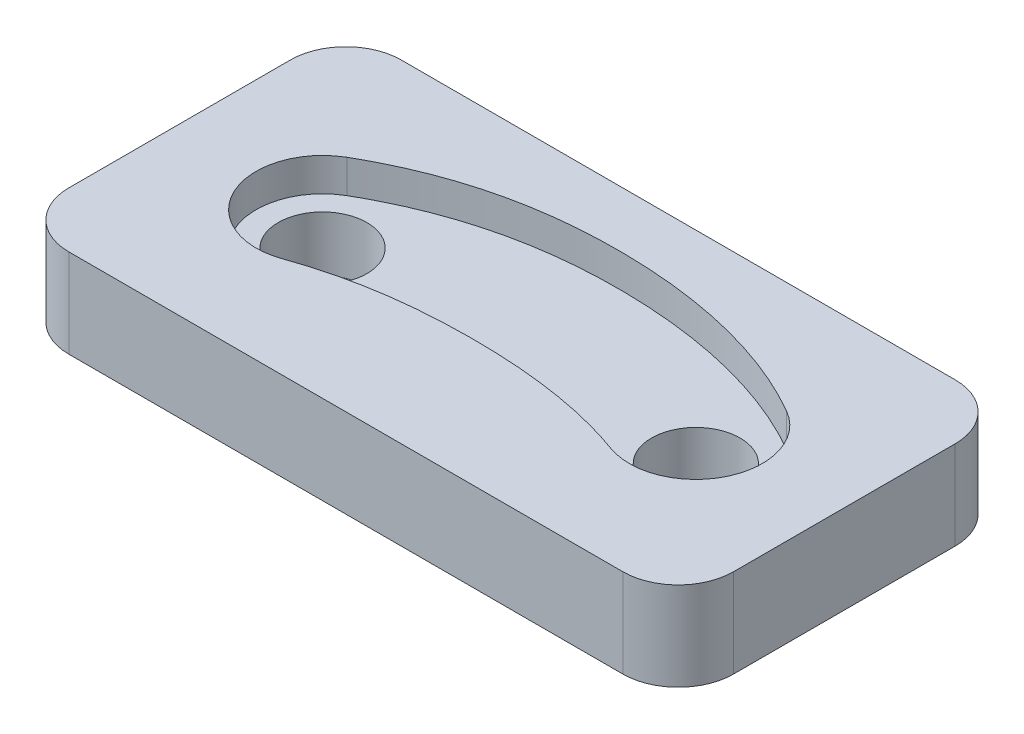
ISO-10303-21;
HEADER;
FILE_DESCRIPTION(('STEP AP214'),'2;1');
FILE_NAME('part.step','',(''),(''),'','','');
FILE_SCHEMA(('AUTOMOTIVE_DESIGN { 1 0 10303 214 1 1 1 1 }'));
ENDSEC;
DATA;
#1=APPLICATION_CONTEXT('core data for automotive mechanical design processes');
#2=APPLICATION_PROTOCOL_DEFINITION('international standard','automotive_design',2000,#1);
#3=PRODUCT_CONTEXT('',#1,'mechanical');
#4=PRODUCT('Part','Part','',(#3));
#5=PRODUCT_RELATED_PRODUCT_CATEGORY('part','',(#4));
#6=PRODUCT_DEFINITION_FORMATION('','',#4);
#7=PRODUCT_DEFINITION_CONTEXT('part definition',#1,'design');
#8=PRODUCT_DEFINITION('design','',#6,#7);
#9=PRODUCT_DEFINITION_SHAPE('','',#8);
#10=(LENGTH_UNIT() NAMED_UNIT(*) SI_UNIT(.MILLI.,.METRE.));
#11=(NAMED_UNIT(*) PLANE_ANGLE_UNIT() SI_UNIT($,.RADIAN.));
#12=(NAMED_UNIT(*) SI_UNIT($,.STERADIAN.) SOLID_ANGLE_UNIT());
#13=UNCERTAINTY_MEASURE_WITH_UNIT(LENGTH_MEASURE(1.E-05),#10,'distance_accuracy_value','');
#14=(GEOMETRIC_REPRESENTATION_CONTEXT(3) GLOBAL_UNCERTAINTY_ASSIGNED_CONTEXT((#13)) GLOBAL_UNIT_ASSIGNED_CONTEXT((#10,
#11,#12)) REPRESENTATION_CONTEXT('',''));
#15=CARTESIAN_POINT('',(0.,0.,0.));
#16=DIRECTION('',(0.,0.,1.));
#17=DIRECTION('',(1.,0.,0.));
#18=AXIS2_PLACEMENT_3D('',#15,#16,#17);
#19=CARTESIAN_POINT('',(0.,11.,0.));
#20=DIRECTION('',(0.,1.,0.));
#21=DIRECTION('',(0.,0.,1.));
#22=AXIS2_PLACEMENT_3D('',#19,#20,#21);
#23=PLANE('',#22);
#24=CARTESIAN_POINT('',(22.9718751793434,11.,17.9993237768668));
#25=CARTESIAN_POINT('',(16.8640977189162,11.,14.4729968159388));
#26=CARTESIAN_POINT('',(2.97690554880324,11.,11.6494435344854));
#27=CARTESIAN_POINT('',(-10.3059382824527,11.,14.2985364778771));
#28=CARTESIAN_POINT('',(-16.7158899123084,11.,17.9993237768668));
#29=B_SPLINE_CURVE_WITH_KNOTS('',3,(#24,#25,#26,#27,#28),.UNSPECIFIED.,.F.,.F.,(4,1,4),(0.,
0.499999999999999,1.),.UNSPECIFIED.);
#30=CARTESIAN_POINT('',(22.9718751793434,11.,17.9993237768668));
#31=VERTEX_POINT('',#30);
#32=CARTESIAN_POINT('',(-16.7158899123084,11.,17.9993237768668));
#33=VERTEX_POINT('',#32);
#34=EDGE_CURVE('E212',#31,#33,#29,.T.);
#35=ORIENTED_EDGE('',*,*,#34,.F.);
#36=CARTESIAN_POINT('',(19.9718751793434,11.,23.1954761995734));
#37=DIRECTION('',(0.,1.,0.));
#38=DIRECTION('',(0.,0.,1.));
#39=AXIS2_PLACEMENT_3D('',#36,#37,#38);
#40=CIRCLE('',#39,6.);
#41=CARTESIAN_POINT('',(17.92513123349,11.,28.8355860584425));
#42=VERTEX_POINT('',#41);
#43=EDGE_CURVE('E226',#42,#31,#40,.T.);
#44=ORIENTED_EDGE('',*,*,#43,.F.);
#45=CARTESIAN_POINT('',(-11.6947578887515,11.,28.8448146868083));
#46=CARTESIAN_POINT('',(-7.07066767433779,11.,27.1904799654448));
#47=CARTESIAN_POINT('',(2.75835465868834,11.,25.9146961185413));
#48=CARTESIAN_POINT('',(13.0214914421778,11.,27.0561003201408));
#49=CARTESIAN_POINT('',(17.92513123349,11.,28.8355860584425));
#50=B_SPLINE_CURVE_WITH_KNOTS('',3,(#45,#46,#47,#48,#49),.UNSPECIFIED.,.F.,.F.,(4,1,4),
(0.146877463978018,0.498521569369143,0.873518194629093),.UNSPECIFIED.);
#51=CARTESIAN_POINT('',(-11.6947578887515,11.,28.8448146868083));
#52=VERTEX_POINT('',#51);
#53=EDGE_CURVE('E113',#52,#42,#50,.T.);
#54=ORIENTED_EDGE('',*,*,#53,.F.);
#55=CARTESIAN_POINT('',(-13.7158899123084,11.,23.1954761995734));
#56=DIRECTION('',(0.,1.,0.));
#57=DIRECTION('',(0.,0.,1.));
#58=AXIS2_PLACEMENT_3D('',#55,#56,#57);
#59=CIRCLE('',#58,6.);
#60=EDGE_CURVE('E262',#33,#52,#59,.T.);
#61=ORIENTED_EDGE('',*,*,#60,.F.);
#62=EDGE_LOOP('',(#35,#44,#54,#61));
#63=FACE_BOUND('',#62,.T.);
#64=DIRECTION('',(-1.,0.,0.));
#65=VECTOR('',#64,1.);
#66=CARTESIAN_POINT('',(0.,11.,37.9419889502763));
#67=LINE('',#66,#65);
#68=CARTESIAN_POINT('',(28.1279926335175,11.,37.9419889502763));
#69=VERTEX_POINT('',#68);
#70=CARTESIAN_POINT('',(-21.8720073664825,11.,37.9419889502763));
#71=VERTEX_POINT('',#70);
#72=EDGE_CURVE('E278',#69,#71,#67,.T.);
#73=ORIENTED_EDGE('',*,*,#72,.F.);
#74=CARTESIAN_POINT('',(28.1279926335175,11.,32.9419889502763));
#75=DIRECTION('',(0.,1.,0.));
#76=DIRECTION('',(0.,0.,1.));
#77=AXIS2_PLACEMENT_3D('',#74,#75,#76);
#78=CIRCLE('',#77,5.);
#79=CARTESIAN_POINT('',(33.1279926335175,11.,32.9419889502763));
#80=VERTEX_POINT('',#79);
#81=EDGE_CURVE('E286',#69,#80,#78,.T.);
#82=ORIENTED_EDGE('',*,*,#81,.T.);
#83=DIRECTION('',(0.,0.,-1.));
#84=VECTOR('',#83,1.);
#85=CARTESIAN_POINT('',(33.1279926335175,11.,0.));
#86=LINE('',#85,#84);
#87=CARTESIAN_POINT('',(33.1279926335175,11.,12.9419889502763));
#88=VERTEX_POINT('',#87);
#89=EDGE_CURVE('E289',#80,#88,#86,.T.);
#90=ORIENTED_EDGE('',*,*,#89,.T.);
#91=CARTESIAN_POINT('',(28.1279926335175,11.,12.9419889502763));
#92=DIRECTION('',(0.,1.,0.));
#93=DIRECTION('',(0.,0.,1.));
#94=AXIS2_PLACEMENT_3D('',#91,#92,#93);
#95=CIRCLE('',#94,5.);
#96=CARTESIAN_POINT('',(28.1279926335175,11.,7.9419889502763));
#97=VERTEX_POINT('',#96);
#98=EDGE_CURVE('E194',#88,#97,#95,.T.);
#99=ORIENTED_EDGE('',*,*,#98,.T.);
#100=DIRECTION('',(-1.,0.,0.));
#101=VECTOR('',#100,1.);
#102=CARTESIAN_POINT('',(0.,11.,7.9419889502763));
#103=LINE('',#102,#101);
#104=CARTESIAN_POINT('',(-21.8720073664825,11.,7.94198895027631));
#105=VERTEX_POINT('',#104);
#106=EDGE_CURVE('E292',#97,#105,#103,.T.);
#107=ORIENTED_EDGE('',*,*,#106,.T.);
#108=CARTESIAN_POINT('',(-21.8720073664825,11.,12.9419889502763));
#109=DIRECTION('',(0.,1.,0.));
#110=DIRECTION('',(0.,0.,1.));
#111=AXIS2_PLACEMENT_3D('',#108,#109,#110);
#112=CIRCLE('',#111,5.);
#113=CARTESIAN_POINT('',(-26.8720073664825,11.,12.9419889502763));
#114=VERTEX_POINT('',#113);
#115=EDGE_CURVE('E295',#114,#105,#112,.F.);
#116=ORIENTED_EDGE('',*,*,#115,.F.);
#117=DIRECTION('',(0.,0.,-1.));
#118=VECTOR('',#117,1.);
#119=CARTESIAN_POINT('',(-26.8720073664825,11.,0.));
#120=LINE('',#119,#118);
#121=CARTESIAN_POINT('',(-26.8720073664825,11.,32.9419889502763));
#122=VERTEX_POINT('',#121);
#123=EDGE_CURVE('E298',#122,#114,#120,.T.);
#124=ORIENTED_EDGE('',*,*,#123,.F.);
#125=CARTESIAN_POINT('',(-21.8720073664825,11.,32.9419889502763));
#126=DIRECTION('',(0.,1.,0.));
#127=DIRECTION('',(0.,0.,1.));
#128=AXIS2_PLACEMENT_3D('',#125,#126,#127);
#129=CIRCLE('',#128,5.);
#130=EDGE_CURVE('E99',#71,#122,#129,.F.);
#131=ORIENTED_EDGE('',*,*,#130,.F.);
#132=EDGE_LOOP('',(#73,#82,#90,#99,#107,#116,#124,#131));
#133=FACE_BOUND('',#132,.T.);
#134=ADVANCED_FACE('F92',(#63,#133),#23,.T.);
#135=CARTESIAN_POINT('',(22.9718751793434,8.,17.9993237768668));
#136=CARTESIAN_POINT('',(16.8640977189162,8.,14.4729968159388));
#137=CARTESIAN_POINT('',(2.97690554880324,8.,11.6494435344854));
#138=CARTESIAN_POINT('',(-10.3059382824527,8.,14.2985364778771));
#139=CARTESIAN_POINT('',(-16.7158899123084,8.,17.9993237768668));
#140=B_SPLINE_CURVE_WITH_KNOTS('',3,(#135,#136,#137,#138,#139),.UNSPECIFIED.,.F.,.F.,(4,1,4),
(0.,0.499999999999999,1.),.UNSPECIFIED.);
#141=DIRECTION('',(0.,1.,0.));
#142=VECTOR('',#141,1.);
#143=SURFACE_OF_LINEAR_EXTRUSION('',#140,#142);
#144=ORIENTED_EDGE('',*,*,#34,.T.);
#145=DIRECTION('',(0.,1.,0.));
#146=VECTOR('',#145,1.);
#147=CARTESIAN_POINT('',(-16.7158899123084,8.,17.9993237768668));
#148=LINE('',#147,#146);
#149=CARTESIAN_POINT('',(-16.7158899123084,8.,17.9993237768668));
#150=VERTEX_POINT('',#149);
#151=EDGE_CURVE('E257',#150,#33,#148,.T.);
#152=ORIENTED_EDGE('',*,*,#151,.F.);
#153=CARTESIAN_POINT('',(22.9718751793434,8.,17.9993237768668));
#154=VERTEX_POINT('',#153);
#155=EDGE_CURVE('E219',#154,#150,#140,.T.);
#156=ORIENTED_EDGE('',*,*,#155,.F.);
#157=DIRECTION('',(0.,1.,0.));
#158=VECTOR('',#157,1.);
#159=CARTESIAN_POINT('',(22.9718751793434,8.,17.9993237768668));
#160=LINE('',#159,#158);
#161=EDGE_CURVE('E276',#154,#31,#160,.T.);
#162=ORIENTED_EDGE('',*,*,#161,.T.);
#163=EDGE_LOOP('',(#144,#152,#156,#162));
#164=FACE_BOUND('',#163,.T.);
#165=ADVANCED_FACE('F231',(#164),#143,.F.);
#166=CARTESIAN_POINT('',(19.9718751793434,8.,23.1954761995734));
#167=DIRECTION('',(0.,1.,0.));
#168=DIRECTION('',(0.,0.,1.));
#169=AXIS2_PLACEMENT_3D('',#166,#167,#168);
#170=CYLINDRICAL_SURFACE('',#169,6.);
#171=ORIENTED_EDGE('',*,*,#43,.T.);
#172=ORIENTED_EDGE('',*,*,#161,.F.);
#173=CARTESIAN_POINT('',(19.9718751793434,8.,23.1954761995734));
#174=DIRECTION('',(0.,1.,0.));
#175=DIRECTION('',(0.,0.,1.));
#176=AXIS2_PLACEMENT_3D('',#173,#174,#175);
#177=CIRCLE('',#176,6.);
#178=CARTESIAN_POINT('',(17.92513123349,8.,28.8355860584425));
#179=VERTEX_POINT('',#178);
#180=EDGE_CURVE('E251',#179,#154,#177,.T.);
#181=ORIENTED_EDGE('',*,*,#180,.F.);
#182=DIRECTION('',(0.,1.,0.));
#183=VECTOR('',#182,1.);
#184=CARTESIAN_POINT('',(17.92513123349,8.,28.8355860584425));
#185=LINE('',#184,#183);
#186=EDGE_CURVE('E279',#179,#42,#185,.T.);
#187=ORIENTED_EDGE('',*,*,#186,.T.);
#188=EDGE_LOOP('',(#171,#172,#181,#187));
#189=FACE_BOUND('',#188,.T.);
#190=ADVANCED_FACE('F234',(#189),#170,.F.);
#191=CARTESIAN_POINT('',(-11.6947578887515,8.,28.8448146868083));
#192=CARTESIAN_POINT('',(-7.07066767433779,8.,27.1904799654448));
#193=CARTESIAN_POINT('',(2.75835465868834,8.,25.9146961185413));
#194=CARTESIAN_POINT('',(13.0214914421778,8.,27.0561003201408));
#195=CARTESIAN_POINT('',(17.92513123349,8.,28.8355860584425));
#196=B_SPLINE_CURVE_WITH_KNOTS('',3,(#191,#192,#193,#194,#195),.UNSPECIFIED.,.F.,.F.,(4,1,4),
(0.146877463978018,0.498521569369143,0.873518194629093),.UNSPECIFIED.);
#197=DIRECTION('',(0.,1.,0.));
#198=VECTOR('',#197,1.);
#199=SURFACE_OF_LINEAR_EXTRUSION('',#196,#198);
#200=ORIENTED_EDGE('',*,*,#53,.T.);
#201=ORIENTED_EDGE('',*,*,#186,.F.);
#202=CARTESIAN_POINT('',(-11.6947578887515,8.,28.8448146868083));
#203=VERTEX_POINT('',#202);
#204=EDGE_CURVE('E245',#203,#179,#196,.T.);
#205=ORIENTED_EDGE('',*,*,#204,.F.);
#206=DIRECTION('',(0.,1.,0.));
#207=VECTOR('',#206,1.);
#208=CARTESIAN_POINT('',(-11.6947578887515,8.,28.8448146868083));
#209=LINE('',#208,#207);
#210=EDGE_CURVE('E281',#203,#52,#209,.T.);
#211=ORIENTED_EDGE('',*,*,#210,.T.);
#212=EDGE_LOOP('',(#200,#201,#205,#211));
#213=FACE_BOUND('',#212,.T.);
#214=ADVANCED_FACE('F240',(#213),#199,.F.);
#215=CARTESIAN_POINT('',(-13.7158899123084,8.,23.1954761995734));
#216=DIRECTION('',(0.,1.,0.));
#217=DIRECTION('',(0.,0.,1.));
#218=AXIS2_PLACEMENT_3D('',#215,#216,#217);
#219=CYLINDRICAL_SURFACE('',#218,6.);
#220=ORIENTED_EDGE('',*,*,#60,.T.);
#221=ORIENTED_EDGE('',*,*,#210,.F.);
#222=CARTESIAN_POINT('',(-13.7158899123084,8.,23.1954761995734));
#223=DIRECTION('',(0.,1.,0.));
#224=DIRECTION('',(0.,0.,1.));
#225=AXIS2_PLACEMENT_3D('',#222,#223,#224);
#226=CIRCLE('',#225,6.);
#227=EDGE_CURVE('E225',#150,#203,#226,.T.);
#228=ORIENTED_EDGE('',*,*,#227,.F.);
#229=ORIENTED_EDGE('',*,*,#151,.T.);
#230=EDGE_LOOP('',(#220,#221,#228,#229));
#231=FACE_BOUND('',#230,.T.);
#232=ADVANCED_FACE('F236',(#231),#219,.F.);
#233=CARTESIAN_POINT('',(3.12799263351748,8.,13.0176050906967));
#234=DIRECTION('',(0.,1.,0.));
#235=DIRECTION('',(0.,0.,1.));
#236=AXIS2_PLACEMENT_3D('',#233,#234,#235);
#237=PLANE('',#236);
#238=CARTESIAN_POINT('',(-13.7158899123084,8.,23.1954761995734));
#239=DIRECTION('',(0.,1.,0.));
#240=DIRECTION('',(0.,0.,1.));
#241=AXIS2_PLACEMENT_3D('',#238,#239,#240);
#242=CIRCLE('',#241,4.);
#243=CARTESIAN_POINT('',(-13.7158899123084,8.,27.1954761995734));
#244=VERTEX_POINT('',#243);
#245=EDGE_CURVE('E209',#244,#244,#242,.T.);
#246=ORIENTED_EDGE('',*,*,#245,.F.);
#247=EDGE_LOOP('',(#246));
#248=FACE_BOUND('',#247,.T.);
#249=CARTESIAN_POINT('',(19.9718751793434,8.,23.1954761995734));
#250=DIRECTION('',(0.,1.,0.));
#251=DIRECTION('',(0.,0.,1.));
#252=AXIS2_PLACEMENT_3D('',#249,#250,#251);
#253=CIRCLE('',#252,4.);
#254=CARTESIAN_POINT('',(19.9718751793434,8.,27.1954761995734));
#255=VERTEX_POINT('',#254);
#256=EDGE_CURVE('E213',#255,#255,#253,.T.);
#257=ORIENTED_EDGE('',*,*,#256,.F.);
#258=EDGE_LOOP('',(#257));
#259=FACE_BOUND('',#258,.T.);
#260=ORIENTED_EDGE('',*,*,#155,.T.);
#261=ORIENTED_EDGE('',*,*,#227,.T.);
#262=ORIENTED_EDGE('',*,*,#204,.T.);
#263=ORIENTED_EDGE('',*,*,#180,.T.);
#264=EDGE_LOOP('',(#260,#261,#262,#263));
#265=FACE_BOUND('',#264,.T.);
#266=ADVANCED_FACE('F239',(#248,#259,#265),#237,.T.);
#267=CARTESIAN_POINT('',(19.9718751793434,3.,23.1954761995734));
#268=DIRECTION('',(0.,1.,0.));
#269=DIRECTION('',(0.,0.,1.));
#270=AXIS2_PLACEMENT_3D('',#267,#268,#269);
#271=CYLINDRICAL_SURFACE('',#270,4.);
#272=CARTESIAN_POINT('',(19.9718751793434,3.,23.1954761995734));
#273=DIRECTION('',(0.,1.,0.));
#274=DIRECTION('',(0.,0.,1.));
#275=AXIS2_PLACEMENT_3D('',#272,#273,#274);
#276=CIRCLE('',#275,4.);
#277=CARTESIAN_POINT('',(19.9718751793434,3.,27.1954761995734));
#278=VERTEX_POINT('',#277);
#279=EDGE_CURVE('E205',#278,#278,#276,.T.);
#280=ORIENTED_EDGE('',*,*,#279,.F.);
#281=EDGE_LOOP('',(#280));
#282=FACE_BOUND('',#281,.T.);
#283=ORIENTED_EDGE('',*,*,#256,.T.);
#284=EDGE_LOOP('',(#283));
#285=FACE_BOUND('',#284,.T.);
#286=ADVANCED_FACE('F369',(#282,#285),#271,.F.);
#287=CARTESIAN_POINT('',(-13.7158899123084,3.,23.1954761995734));
#288=DIRECTION('',(0.,1.,0.));
#289=DIRECTION('',(0.,0.,1.));
#290=AXIS2_PLACEMENT_3D('',#287,#288,#289);
#291=CYLINDRICAL_SURFACE('',#290,4.);
#292=CARTESIAN_POINT('',(-13.7158899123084,3.,23.1954761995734));
#293=DIRECTION('',(0.,1.,0.));
#294=DIRECTION('',(0.,0.,1.));
#295=AXIS2_PLACEMENT_3D('',#292,#293,#294);
#296=CIRCLE('',#295,4.);
#297=CARTESIAN_POINT('',(-13.7158899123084,3.,27.1954761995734));
#298=VERTEX_POINT('',#297);
#299=EDGE_CURVE('E206',#298,#298,#296,.T.);
#300=ORIENTED_EDGE('',*,*,#299,.F.);
#301=EDGE_LOOP('',(#300));
#302=FACE_BOUND('',#301,.T.);
#303=ORIENTED_EDGE('',*,*,#245,.T.);
#304=EDGE_LOOP('',(#303));
#305=FACE_BOUND('',#304,.T.);
#306=ADVANCED_FACE('F351',(#302,#305),#291,.F.);
#307=CARTESIAN_POINT('',(0.,0.,7.9419889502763));
#308=DIRECTION('',(0.,0.,-1.));
#309=DIRECTION('',(-1.,0.,0.));
#310=AXIS2_PLACEMENT_3D('',#307,#308,#309);
#311=PLANE('',#310);
#312=DIRECTION('',(1.,0.,0.));
#313=VECTOR('',#312,1.);
#314=CARTESIAN_POINT('',(0.,3.,7.9419889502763));
#315=LINE('',#314,#313);
#316=CARTESIAN_POINT('',(-21.8720073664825,3.,7.94198895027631));
#317=VERTEX_POINT('',#316);
#318=CARTESIAN_POINT('',(28.1279926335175,3.,7.9419889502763));
#319=VERTEX_POINT('',#318);
#320=EDGE_CURVE('E105',#317,#319,#315,.T.);
#321=ORIENTED_EDGE('',*,*,#320,.F.);
#322=DIRECTION('',(0.,1.,0.));
#323=VECTOR('',#322,1.);
#324=CARTESIAN_POINT('',(-21.8720073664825,0.,7.94198895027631));
#325=LINE('',#324,#323);
#326=EDGE_CURVE('E200',#317,#105,#325,.T.);
#327=ORIENTED_EDGE('',*,*,#326,.T.);
#328=ORIENTED_EDGE('',*,*,#106,.F.);
#329=DIRECTION('',(0.,1.,0.));
#330=VECTOR('',#329,1.);
#331=CARTESIAN_POINT('',(28.1279926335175,0.,7.9419889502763));
#332=LINE('',#331,#330);
#333=EDGE_CURVE('E196',#319,#97,#332,.T.);
#334=ORIENTED_EDGE('',*,*,#333,.F.);
#335=EDGE_LOOP('',(#321,#327,#328,#334));
#336=FACE_BOUND('',#335,.T.);
#337=ADVANCED_FACE('F332',(#336),#311,.T.);
#338=CARTESIAN_POINT('',(-21.8720073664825,0.,12.9419889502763));
#339=DIRECTION('',(0.,1.,0.));
#340=DIRECTION('',(0.,0.,1.));
#341=AXIS2_PLACEMENT_3D('',#338,#339,#340);
#342=CYLINDRICAL_SURFACE('',#341,5.);
#343=ORIENTED_EDGE('',*,*,#326,.F.);
#344=CARTESIAN_POINT('',(-21.8720073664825,3.,12.9419889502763));
#345=DIRECTION('',(0.,1.,0.));
#346=DIRECTION('',(0.,0.,1.));
#347=AXIS2_PLACEMENT_3D('',#344,#345,#346);
#348=CIRCLE('',#347,5.);
#349=CARTESIAN_POINT('',(-26.8720073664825,3.,12.9419889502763));
#350=VERTEX_POINT('',#349);
#351=EDGE_CURVE('E337',#317,#350,#348,.T.);
#352=ORIENTED_EDGE('',*,*,#351,.T.);
#353=DIRECTION('',(0.,1.,0.));
#354=VECTOR('',#353,1.);
#355=CARTESIAN_POINT('',(-26.8720073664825,0.,12.9419889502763));
#356=LINE('',#355,#354);
#357=EDGE_CURVE('E216',#350,#114,#356,.T.);
#358=ORIENTED_EDGE('',*,*,#357,.T.);
#359=ORIENTED_EDGE('',*,*,#115,.T.);
#360=EDGE_LOOP('',(#343,#352,#358,#359));
#361=FACE_BOUND('',#360,.T.);
#362=ADVANCED_FACE('F336',(#361),#342,.T.);
#363=CARTESIAN_POINT('',(-26.8720073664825,0.,0.));
#364=DIRECTION('',(1.,0.,0.));
#365=DIRECTION('',(0.,0.,-1.));
#366=AXIS2_PLACEMENT_3D('',#363,#364,#365);
#367=PLANE('',#366);
#368=ORIENTED_EDGE('',*,*,#357,.F.);
#369=DIRECTION('',(0.,0.,1.));
#370=VECTOR('',#369,1.);
#371=CARTESIAN_POINT('',(-26.8720073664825,3.,0.));
#372=LINE('',#371,#370);
#373=CARTESIAN_POINT('',(-26.8720073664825,3.,32.9419889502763));
#374=VERTEX_POINT('',#373);
#375=EDGE_CURVE('E317',#350,#374,#372,.T.);
#376=ORIENTED_EDGE('',*,*,#375,.T.);
#377=DIRECTION('',(0.,1.,0.));
#378=VECTOR('',#377,1.);
#379=CARTESIAN_POINT('',(-26.8720073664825,0.,32.9419889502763));
#380=LINE('',#379,#378);
#381=EDGE_CURVE('E307',#374,#122,#380,.T.);
#382=ORIENTED_EDGE('',*,*,#381,.T.);
#383=ORIENTED_EDGE('',*,*,#123,.T.);
#384=EDGE_LOOP('',(#368,#376,#382,#383));
#385=FACE_BOUND('',#384,.T.);
#386=ADVANCED_FACE('F315',(#385),#367,.F.);
#387=CARTESIAN_POINT('',(-21.8720073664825,0.,32.9419889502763));
#388=DIRECTION('',(0.,1.,0.));
#389=DIRECTION('',(0.,0.,1.));
#390=AXIS2_PLACEMENT_3D('',#387,#388,#389);
#391=CYLINDRICAL_SURFACE('',#390,5.);
#392=ORIENTED_EDGE('',*,*,#381,.F.);
#393=CARTESIAN_POINT('',(-21.8720073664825,3.,32.9419889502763));
#394=DIRECTION('',(0.,1.,0.));
#395=DIRECTION('',(0.,0.,1.));
#396=AXIS2_PLACEMENT_3D('',#393,#394,#395);
#397=CIRCLE('',#396,5.);
#398=CARTESIAN_POINT('',(-21.8720073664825,3.,37.9419889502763));
#399=VERTEX_POINT('',#398);
#400=EDGE_CURVE('E339',#374,#399,#397,.T.);
#401=ORIENTED_EDGE('',*,*,#400,.T.);
#402=DIRECTION('',(0.,1.,0.));
#403=VECTOR('',#402,1.);
#404=CARTESIAN_POINT('',(-21.8720073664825,0.,37.9419889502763));
#405=LINE('',#404,#403);
#406=EDGE_CURVE('E309',#399,#71,#405,.T.);
#407=ORIENTED_EDGE('',*,*,#406,.T.);
#408=ORIENTED_EDGE('',*,*,#130,.T.);
#409=EDGE_LOOP('',(#392,#401,#407,#408));
#410=FACE_BOUND('',#409,.T.);
#411=ADVANCED_FACE('F305',(#410),#391,.T.);
#412=CARTESIAN_POINT('',(0.,0.,37.9419889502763));
#413=DIRECTION('',(0.,0.,-1.));
#414=DIRECTION('',(-1.,0.,0.));
#415=AXIS2_PLACEMENT_3D('',#412,#413,#414);
#416=PLANE('',#415);
#417=ORIENTED_EDGE('',*,*,#406,.F.);
#418=DIRECTION('',(1.,0.,0.));
#419=VECTOR('',#418,1.);
#420=CARTESIAN_POINT('',(0.,3.,37.9419889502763));
#421=LINE('',#420,#419);
#422=CARTESIAN_POINT('',(28.1279926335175,3.,37.9419889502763));
#423=VERTEX_POINT('',#422);
#424=EDGE_CURVE('E327',#399,#423,#421,.T.);
#425=ORIENTED_EDGE('',*,*,#424,.T.);
#426=DIRECTION('',(0.,1.,0.));
#427=VECTOR('',#426,1.);
#428=CARTESIAN_POINT('',(28.1279926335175,0.,37.9419889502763));
#429=LINE('',#428,#427);
#430=EDGE_CURVE('E198',#423,#69,#429,.T.);
#431=ORIENTED_EDGE('',*,*,#430,.T.);
#432=ORIENTED_EDGE('',*,*,#72,.T.);
#433=EDGE_LOOP('',(#417,#425,#431,#432));
#434=FACE_BOUND('',#433,.T.);
#435=ADVANCED_FACE('F326',(#434),#416,.F.);
#436=CARTESIAN_POINT('',(28.1279926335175,0.,32.9419889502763));
#437=DIRECTION('',(0.,1.,0.));
#438=DIRECTION('',(0.,0.,1.));
#439=AXIS2_PLACEMENT_3D('',#436,#437,#438);
#440=CYLINDRICAL_SURFACE('',#439,5.);
#441=CARTESIAN_POINT('',(28.1279926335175,3.,32.9419889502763));
#442=DIRECTION('',(0.,1.,0.));
#443=DIRECTION('',(0.,0.,1.));
#444=AXIS2_PLACEMENT_3D('',#441,#442,#443);
#445=CIRCLE('',#444,5.);
#446=CARTESIAN_POINT('',(33.1279926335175,3.,32.9419889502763));
#447=VERTEX_POINT('',#446);
#448=EDGE_CURVE('E190',#447,#423,#445,.F.);
#449=ORIENTED_EDGE('',*,*,#448,.F.);
#450=DIRECTION('',(0.,1.,0.));
#451=VECTOR('',#450,1.);
#452=CARTESIAN_POINT('',(33.1279926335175,0.,32.9419889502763));
#453=LINE('',#452,#451);
#454=EDGE_CURVE('E189',#447,#80,#453,.T.);
#455=ORIENTED_EDGE('',*,*,#454,.T.);
#456=ORIENTED_EDGE('',*,*,#81,.F.);
#457=ORIENTED_EDGE('',*,*,#430,.F.);
#458=EDGE_LOOP('',(#449,#455,#456,#457));
#459=FACE_BOUND('',#458,.T.);
#460=ADVANCED_FACE('F329',(#459),#440,.T.);
#461=CARTESIAN_POINT('',(33.1279926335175,0.,0.));
#462=DIRECTION('',(1.,0.,0.));
#463=DIRECTION('',(0.,0.,-1.));
#464=AXIS2_PLACEMENT_3D('',#461,#462,#463);
#465=PLANE('',#464);
#466=DIRECTION('',(0.,0.,1.));
#467=VECTOR('',#466,1.);
#468=CARTESIAN_POINT('',(33.1279926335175,3.,0.));
#469=LINE('',#468,#467);
#470=CARTESIAN_POINT('',(33.1279926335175,3.,12.9419889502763));
#471=VERTEX_POINT('',#470);
#472=EDGE_CURVE('E178',#471,#447,#469,.T.);
#473=ORIENTED_EDGE('',*,*,#472,.F.);
#474=DIRECTION('',(0.,1.,0.));
#475=VECTOR('',#474,1.);
#476=CARTESIAN_POINT('',(33.1279926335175,0.,12.9419889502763));
#477=LINE('',#476,#475);
#478=EDGE_CURVE('E187',#471,#88,#477,.T.);
#479=ORIENTED_EDGE('',*,*,#478,.T.);
#480=ORIENTED_EDGE('',*,*,#89,.F.);
#481=ORIENTED_EDGE('',*,*,#454,.F.);
#482=EDGE_LOOP('',(#473,#479,#480,#481));
#483=FACE_BOUND('',#482,.T.);
#484=ADVANCED_FACE('F185',(#483),#465,.T.);
#485=CARTESIAN_POINT('',(28.1279926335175,0.,12.9419889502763));
#486=DIRECTION('',(0.,1.,0.));
#487=DIRECTION('',(0.,0.,1.));
#488=AXIS2_PLACEMENT_3D('',#485,#486,#487);
#489=CYLINDRICAL_SURFACE('',#488,5.);
#490=CARTESIAN_POINT('',(28.1279926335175,3.,12.9419889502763));
#491=DIRECTION('',(0.,1.,0.));
#492=DIRECTION('',(0.,0.,1.));
#493=AXIS2_PLACEMENT_3D('',#490,#491,#492);
#494=CIRCLE('',#493,5.);
#495=EDGE_CURVE('E12',#319,#471,#494,.F.);
#496=ORIENTED_EDGE('',*,*,#495,.F.);
#497=ORIENTED_EDGE('',*,*,#333,.T.);
#498=ORIENTED_EDGE('',*,*,#98,.F.);
#499=ORIENTED_EDGE('',*,*,#478,.F.);
#500=EDGE_LOOP('',(#496,#497,#498,#499));
#501=FACE_BOUND('',#500,.T.);
#502=ADVANCED_FACE('F192',(#501),#489,.T.);
#503=CARTESIAN_POINT('',(19.9718751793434,3.,23.1954761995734));
#504=DIRECTION('',(0.,1.,0.));
#505=DIRECTION('',(0.,0.,1.));
#506=AXIS2_PLACEMENT_3D('',#503,#504,#505);
#507=PLANE('',#506);
#508=ORIENTED_EDGE('',*,*,#279,.T.);
#509=EDGE_LOOP('',(#508));
#510=FACE_BOUND('',#509,.T.);
#511=ORIENTED_EDGE('',*,*,#299,.T.);
#512=EDGE_LOOP('',(#511));
#513=FACE_BOUND('',#512,.T.);
#514=ORIENTED_EDGE('',*,*,#320,.T.);
#515=ORIENTED_EDGE('',*,*,#495,.T.);
#516=ORIENTED_EDGE('',*,*,#472,.T.);
#517=ORIENTED_EDGE('',*,*,#448,.T.);
#518=ORIENTED_EDGE('',*,*,#424,.F.);
#519=ORIENTED_EDGE('',*,*,#400,.F.);
#520=ORIENTED_EDGE('',*,*,#375,.F.);
#521=ORIENTED_EDGE('',*,*,#351,.F.);
#522=EDGE_LOOP('',(#514,#515,#516,#517,#518,#519,#520,#521));
#523=FACE_BOUND('',#522,.T.);
#524=ADVANCED_FACE('F177',(#510,#513,#523),#507,.F.);
#525=CLOSED_SHELL('',(#134,#165,#190,#214,#232,#266,#286,#306,#337,#362,#386,#411,#435,#460,
#484,#502,#524));
#526=MANIFOLD_SOLID_BREP('B2',#525);
#527=ADVANCED_BREP_SHAPE_REPRESENTATION('',(#18,#526),#14);
#528=SHAPE_DEFINITION_REPRESENTATION(#9,#527);
ENDSEC;
END-ISO-10303-21;
